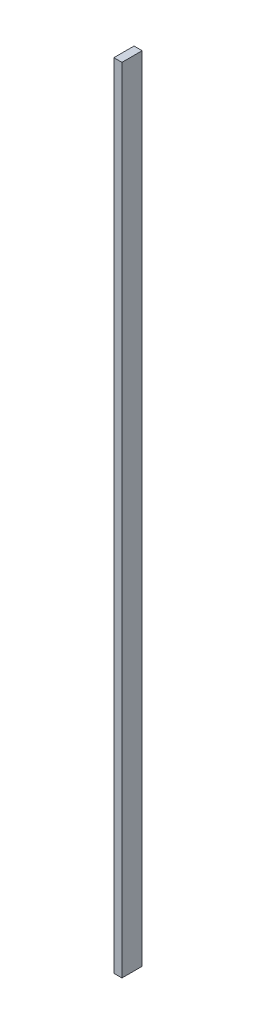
ISO-10303-21;
HEADER;
FILE_DESCRIPTION(('STEP AP214'),'2;1');
FILE_NAME('part.step','',(''),(''),'','','');
FILE_SCHEMA(('AUTOMOTIVE_DESIGN { 1 0 10303 214 1 1 1 1 }'));
ENDSEC;
DATA;
#1=APPLICATION_CONTEXT('core data for automotive mechanical design processes');
#2=APPLICATION_PROTOCOL_DEFINITION('international standard','automotive_design',2000,#1);
#3=PRODUCT_CONTEXT('',#1,'mechanical');
#4=PRODUCT('Part','Part','',(#3));
#5=PRODUCT_RELATED_PRODUCT_CATEGORY('part','',(#4));
#6=PRODUCT_DEFINITION_FORMATION('','',#4);
#7=PRODUCT_DEFINITION_CONTEXT('part definition',#1,'design');
#8=PRODUCT_DEFINITION('design','',#6,#7);
#9=PRODUCT_DEFINITION_SHAPE('','',#8);
#10=(LENGTH_UNIT() NAMED_UNIT(*) SI_UNIT(.MILLI.,.METRE.));
#11=(NAMED_UNIT(*) PLANE_ANGLE_UNIT() SI_UNIT($,.RADIAN.));
#12=(NAMED_UNIT(*) SI_UNIT($,.STERADIAN.) SOLID_ANGLE_UNIT());
#13=UNCERTAINTY_MEASURE_WITH_UNIT(LENGTH_MEASURE(1.E-05),#10,'distance_accuracy_value','');
#14=(GEOMETRIC_REPRESENTATION_CONTEXT(3) GLOBAL_UNCERTAINTY_ASSIGNED_CONTEXT((#13)) GLOBAL_UNIT_ASSIGNED_CONTEXT((#10,
#11,#12)) REPRESENTATION_CONTEXT('',''));
#15=CARTESIAN_POINT('',(0.,0.,0.));
#16=DIRECTION('',(0.,0.,1.));
#17=DIRECTION('',(1.,0.,0.));
#18=AXIS2_PLACEMENT_3D('',#15,#16,#17);
#19=CARTESIAN_POINT('',(0.,1960.,0.));
#20=DIRECTION('',(1.,0.,0.));
#21=DIRECTION('',(0.,0.,-1.));
#22=AXIS2_PLACEMENT_3D('',#19,#20,#21);
#23=PLANE('',#22);
#24=DIRECTION('',(0.,0.,1.));
#25=VECTOR('',#24,1.);
#26=CARTESIAN_POINT('',(0.,0.,0.));
#27=LINE('',#26,#25);
#28=CARTESIAN_POINT('',(0.,0.,-50.));
#29=VERTEX_POINT('',#28);
#30=CARTESIAN_POINT('',(0.,0.,0.));
#31=VERTEX_POINT('',#30);
#32=EDGE_CURVE('E95',#29,#31,#27,.T.);
#33=ORIENTED_EDGE('',*,*,#32,.T.);
#34=DIRECTION('',(0.,-1.,0.));
#35=VECTOR('',#34,1.);
#36=CARTESIAN_POINT('',(0.,1960.,0.));
#37=LINE('',#36,#35);
#38=CARTESIAN_POINT('',(0.,1960.,0.));
#39=VERTEX_POINT('',#38);
#40=EDGE_CURVE('E11',#39,#31,#37,.T.);
#41=ORIENTED_EDGE('',*,*,#40,.F.);
#42=DIRECTION('',(0.,0.,1.));
#43=VECTOR('',#42,1.);
#44=CARTESIAN_POINT('',(0.,1960.,0.));
#45=LINE('',#44,#43);
#46=CARTESIAN_POINT('',(0.,1960.,-50.));
#47=VERTEX_POINT('',#46);
#48=EDGE_CURVE('E83',#47,#39,#45,.T.);
#49=ORIENTED_EDGE('',*,*,#48,.F.);
#50=DIRECTION('',(0.,-1.,0.));
#51=VECTOR('',#50,1.);
#52=CARTESIAN_POINT('',(0.,1960.,-50.));
#53=LINE('',#52,#51);
#54=EDGE_CURVE('E91',#47,#29,#53,.T.);
#55=ORIENTED_EDGE('',*,*,#54,.T.);
#56=EDGE_LOOP('',(#33,#41,#49,#55));
#57=FACE_BOUND('',#56,.T.);
#58=ADVANCED_FACE('F32',(#57),#23,.F.);
#59=CARTESIAN_POINT('',(0.,1960.,0.));
#60=DIRECTION('',(0.,0.,-1.));
#61=DIRECTION('',(-1.,0.,0.));
#62=AXIS2_PLACEMENT_3D('',#59,#60,#61);
#63=PLANE('',#62);
#64=DIRECTION('',(1.,0.,0.));
#65=VECTOR('',#64,1.);
#66=CARTESIAN_POINT('',(0.,0.,0.));
#67=LINE('',#66,#65);
#68=CARTESIAN_POINT('',(20.,0.,0.));
#69=VERTEX_POINT('',#68);
#70=EDGE_CURVE('E87',#31,#69,#67,.T.);
#71=ORIENTED_EDGE('',*,*,#70,.T.);
#72=DIRECTION('',(0.,-1.,0.));
#73=VECTOR('',#72,1.);
#74=CARTESIAN_POINT('',(20.,1960.,0.));
#75=LINE('',#74,#73);
#76=CARTESIAN_POINT('',(20.,1960.,0.));
#77=VERTEX_POINT('',#76);
#78=EDGE_CURVE('E40',#77,#69,#75,.T.);
#79=ORIENTED_EDGE('',*,*,#78,.F.);
#80=DIRECTION('',(1.,0.,0.));
#81=VECTOR('',#80,1.);
#82=CARTESIAN_POINT('',(0.,1960.,0.));
#83=LINE('',#82,#81);
#84=EDGE_CURVE('E78',#39,#77,#83,.T.);
#85=ORIENTED_EDGE('',*,*,#84,.F.);
#86=ORIENTED_EDGE('',*,*,#40,.T.);
#87=EDGE_LOOP('',(#71,#79,#85,#86));
#88=FACE_BOUND('',#87,.T.);
#89=ADVANCED_FACE('F86',(#88),#63,.F.);
#90=CARTESIAN_POINT('',(20.,1960.,0.));
#91=DIRECTION('',(-1.,0.,0.));
#92=DIRECTION('',(0.,0.,1.));
#93=AXIS2_PLACEMENT_3D('',#90,#91,#92);
#94=PLANE('',#93);
#95=DIRECTION('',(0.,0.,-1.));
#96=VECTOR('',#95,1.);
#97=CARTESIAN_POINT('',(20.,0.,0.));
#98=LINE('',#97,#96);
#99=CARTESIAN_POINT('',(20.,0.,-50.));
#100=VERTEX_POINT('',#99);
#101=EDGE_CURVE('E65',#69,#100,#98,.T.);
#102=ORIENTED_EDGE('',*,*,#101,.T.);
#103=DIRECTION('',(0.,-1.,0.));
#104=VECTOR('',#103,1.);
#105=CARTESIAN_POINT('',(20.,1960.,-50.));
#106=LINE('',#105,#104);
#107=CARTESIAN_POINT('',(20.,1960.,-50.));
#108=VERTEX_POINT('',#107);
#109=EDGE_CURVE('E88',#108,#100,#106,.T.);
#110=ORIENTED_EDGE('',*,*,#109,.F.);
#111=DIRECTION('',(0.,0.,-1.));
#112=VECTOR('',#111,1.);
#113=CARTESIAN_POINT('',(20.,1960.,0.));
#114=LINE('',#113,#112);
#115=EDGE_CURVE('E81',#77,#108,#114,.T.);
#116=ORIENTED_EDGE('',*,*,#115,.F.);
#117=ORIENTED_EDGE('',*,*,#78,.T.);
#118=EDGE_LOOP('',(#102,#110,#116,#117));
#119=FACE_BOUND('',#118,.T.);
#120=ADVANCED_FACE('F89',(#119),#94,.F.);
#121=CARTESIAN_POINT('',(0.,1960.,-50.));
#122=DIRECTION('',(0.,0.,1.));
#123=DIRECTION('',(1.,0.,0.));
#124=AXIS2_PLACEMENT_3D('',#121,#122,#123);
#125=PLANE('',#124);
#126=DIRECTION('',(-1.,0.,0.));
#127=VECTOR('',#126,1.);
#128=CARTESIAN_POINT('',(0.,0.,-50.));
#129=LINE('',#128,#127);
#130=EDGE_CURVE('E71',#100,#29,#129,.T.);
#131=ORIENTED_EDGE('',*,*,#130,.T.);
#132=ORIENTED_EDGE('',*,*,#54,.F.);
#133=DIRECTION('',(-1.,0.,0.));
#134=VECTOR('',#133,1.);
#135=CARTESIAN_POINT('',(0.,1960.,-50.));
#136=LINE('',#135,#134);
#137=EDGE_CURVE('E48',#108,#47,#136,.T.);
#138=ORIENTED_EDGE('',*,*,#137,.F.);
#139=ORIENTED_EDGE('',*,*,#109,.T.);
#140=EDGE_LOOP('',(#131,#132,#138,#139));
#141=FACE_BOUND('',#140,.T.);
#142=ADVANCED_FACE('F102',(#141),#125,.F.);
#143=CARTESIAN_POINT('',(0.,1960.,-50.));
#144=DIRECTION('',(0.,-1.,0.));
#145=DIRECTION('',(0.,0.,-1.));
#146=AXIS2_PLACEMENT_3D('',#143,#144,#145);
#147=PLANE('',#146);
#148=ORIENTED_EDGE('',*,*,#48,.T.);
#149=ORIENTED_EDGE('',*,*,#84,.T.);
#150=ORIENTED_EDGE('',*,*,#115,.T.);
#151=ORIENTED_EDGE('',*,*,#137,.T.);
#152=EDGE_LOOP('',(#148,#149,#150,#151));
#153=FACE_BOUND('',#152,.T.);
#154=ADVANCED_FACE('F79',(#153),#147,.F.);
#155=CARTESIAN_POINT('',(0.,0.,-50.));
#156=DIRECTION('',(0.,-1.,0.));
#157=DIRECTION('',(0.,0.,-1.));
#158=AXIS2_PLACEMENT_3D('',#155,#156,#157);
#159=PLANE('',#158);
#160=ORIENTED_EDGE('',*,*,#32,.F.);
#161=ORIENTED_EDGE('',*,*,#130,.F.);
#162=ORIENTED_EDGE('',*,*,#101,.F.);
#163=ORIENTED_EDGE('',*,*,#70,.F.);
#164=EDGE_LOOP('',(#160,#161,#162,#163));
#165=FACE_BOUND('',#164,.T.);
#166=ADVANCED_FACE('F105',(#165),#159,.T.);
#167=CLOSED_SHELL('',(#58,#89,#120,#142,#154,#166));
#168=MANIFOLD_SOLID_BREP('B2',#167);
#169=ADVANCED_BREP_SHAPE_REPRESENTATION('',(#18,#168),#14);
#170=SHAPE_DEFINITION_REPRESENTATION(#9,#169);
ENDSEC;
END-ISO-10303-21;
